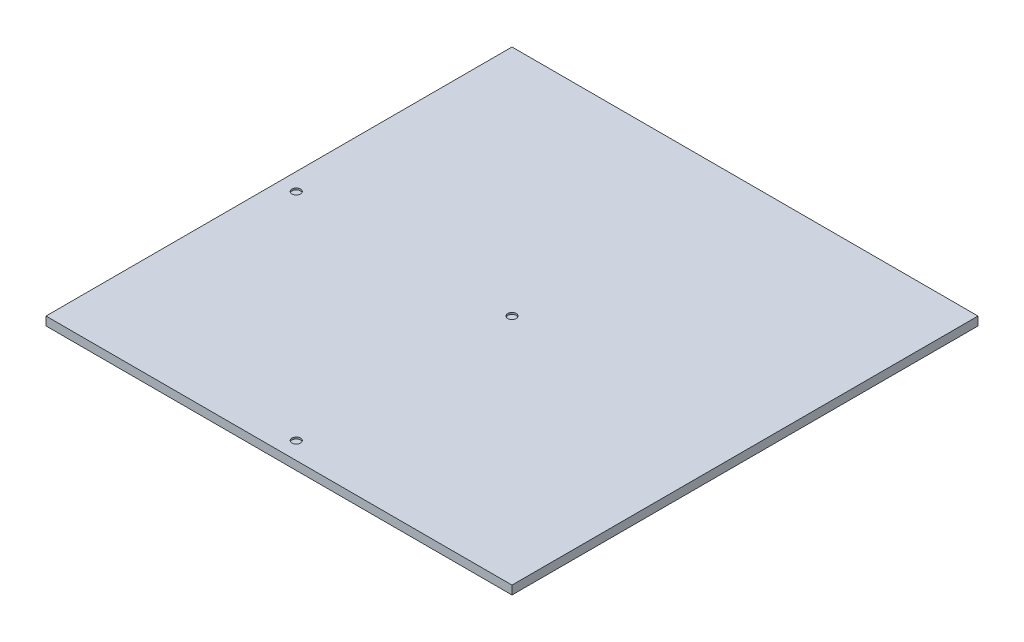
from build123d import *

# Parameters (mm, degrees)
SKETCH1_W           = 270
SKETCH1_H           = 270
BOSS_EXTRUDE1_DEPTH = 5
SKETCH2_R           = 2.5
CUT_EXTRUDE1_DEPTH  = 1
SKETCH3_R           = 2.5
CUT_EXTRUDE2_DEPTH  = 1
SKETCH4_R           = 2.5
CUT_EXTRUDE3_DEPTH  = 1


with BuildPart() as part:
    # Sketch1 → Boss-Extrude1 (new body)
    with BuildSketch(Plane(origin=(0, 0, 0), x_dir=(1, 0, 0), z_dir=(0, 1, 0))):
        with Locations((135, 135)):
            Rectangle(SKETCH1_W, SKETCH1_H)
    extrude(amount=BOSS_EXTRUDE1_DEPTH)

    # Sketch2 → Cut-Extrude1 (cut)
    with BuildSketch(Plane(origin=(0, 5, 0), x_dir=(1, 0, 0), z_dir=(0, 1, 0))):
        with Locations(Location((135, 135, 0), (0, 0, 270))):
            Circle(SKETCH2_R)
    extrude(amount=-CUT_EXTRUDE1_DEPTH, mode=Mode.SUBTRACT)

    # Sketch3 → Cut-Extrude2 (cut)
    with BuildSketch(Plane(origin=(0, 5, 0), x_dir=(1, 0, 0), z_dir=(0, 1, 0))):
        with Locations(Location((135, 10, 0), (0, 0, 270))):
            Circle(SKETCH3_R)
    extrude(amount=-CUT_EXTRUDE2_DEPTH, mode=Mode.SUBTRACT)

    # Sketch4 → Cut-Extrude3 (cut)
    with BuildSketch(Plane(origin=(0, 5, 0), x_dir=(1, 0, 0), z_dir=(0, 1, 0))):
        with Locations(Location((10, 135, 0), (0, 0, 270))):
            Circle(SKETCH4_R)
    extrude(amount=-CUT_EXTRUDE3_DEPTH, mode=Mode.SUBTRACT)


solid = part.part
